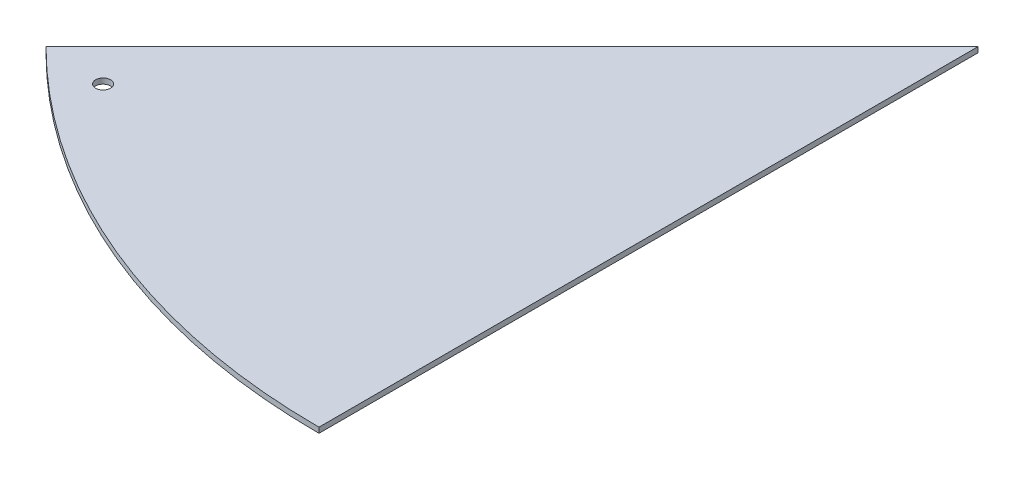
ISO-10303-21;
HEADER;
FILE_DESCRIPTION(('STEP AP214'),'2;1');
FILE_NAME('part.step','',(''),(''),'','','');
FILE_SCHEMA(('AUTOMOTIVE_DESIGN { 1 0 10303 214 1 1 1 1 }'));
ENDSEC;
DATA;
#1=APPLICATION_CONTEXT('core data for automotive mechanical design processes');
#2=APPLICATION_PROTOCOL_DEFINITION('international standard','automotive_design',2000,#1);
#3=PRODUCT_CONTEXT('',#1,'mechanical');
#4=PRODUCT('Part','Part','',(#3));
#5=PRODUCT_RELATED_PRODUCT_CATEGORY('part','',(#4));
#6=PRODUCT_DEFINITION_FORMATION('','',#4);
#7=PRODUCT_DEFINITION_CONTEXT('part definition',#1,'design');
#8=PRODUCT_DEFINITION('design','',#6,#7);
#9=PRODUCT_DEFINITION_SHAPE('','',#8);
#10=(LENGTH_UNIT() NAMED_UNIT(*) SI_UNIT(.MILLI.,.METRE.));
#11=(NAMED_UNIT(*) PLANE_ANGLE_UNIT() SI_UNIT($,.RADIAN.));
#12=(NAMED_UNIT(*) SI_UNIT($,.STERADIAN.) SOLID_ANGLE_UNIT());
#13=UNCERTAINTY_MEASURE_WITH_UNIT(LENGTH_MEASURE(1.E-05),#10,'distance_accuracy_value','');
#14=(GEOMETRIC_REPRESENTATION_CONTEXT(3) GLOBAL_UNCERTAINTY_ASSIGNED_CONTEXT((#13)) GLOBAL_UNIT_ASSIGNED_CONTEXT((#10,
#11,#12)) REPRESENTATION_CONTEXT('',''));
#15=CARTESIAN_POINT('',(0.,0.,0.));
#16=DIRECTION('',(0.,0.,1.));
#17=DIRECTION('',(1.,0.,0.));
#18=AXIS2_PLACEMENT_3D('',#15,#16,#17);
#19=CARTESIAN_POINT('',(0.,20.,0.));
#20=DIRECTION('',(0.707106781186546,0.,0.707106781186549));
#21=DIRECTION('',(0.707106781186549,0.,-0.707106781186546));
#22=AXIS2_PLACEMENT_3D('',#19,#20,#21);
#23=PLANE('',#22);
#24=DIRECTION('',(-0.707106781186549,0.,0.707106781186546));
#25=VECTOR('',#24,1.);
#26=CARTESIAN_POINT('',(0.,0.,0.));
#27=LINE('',#26,#25);
#28=CARTESIAN_POINT('',(0.,0.,0.));
#29=VERTEX_POINT('',#28);
#30=CARTESIAN_POINT('',(-1732.41161390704,0.,1732.41161390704));
#31=VERTEX_POINT('',#30);
#32=EDGE_CURVE('E79',#29,#31,#27,.T.);
#33=ORIENTED_EDGE('',*,*,#32,.T.);
#34=DIRECTION('',(0.,-1.,0.));
#35=VECTOR('',#34,1.);
#36=CARTESIAN_POINT('',(-1732.41161390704,20.,1732.41161390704));
#37=LINE('',#36,#35);
#38=CARTESIAN_POINT('',(-1732.41161390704,20.,1732.41161390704));
#39=VERTEX_POINT('',#38);
#40=EDGE_CURVE('E11',#39,#31,#37,.T.);
#41=ORIENTED_EDGE('',*,*,#40,.F.);
#42=DIRECTION('',(-0.707106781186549,0.,0.707106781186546));
#43=VECTOR('',#42,1.);
#44=CARTESIAN_POINT('',(0.,20.,0.));
#45=LINE('',#44,#43);
#46=CARTESIAN_POINT('',(0.,20.,0.));
#47=VERTEX_POINT('',#46);
#48=EDGE_CURVE('E72',#47,#39,#45,.T.);
#49=ORIENTED_EDGE('',*,*,#48,.F.);
#50=DIRECTION('',(0.,-1.,0.));
#51=VECTOR('',#50,1.);
#52=CARTESIAN_POINT('',(0.,20.,0.));
#53=LINE('',#52,#51);
#54=EDGE_CURVE('E80',#47,#29,#53,.T.);
#55=ORIENTED_EDGE('',*,*,#54,.T.);
#56=EDGE_LOOP('',(#33,#41,#49,#55));
#57=FACE_BOUND('',#56,.T.);
#58=ADVANCED_FACE('F32',(#57),#23,.F.);
#59=CARTESIAN_POINT('',(0.,20.,0.));
#60=DIRECTION('',(0.,-1.,0.));
#61=DIRECTION('',(0.,0.,-1.));
#62=AXIS2_PLACEMENT_3D('',#59,#60,#61);
#63=CYLINDRICAL_SURFACE('',#62,2450.);
#64=CARTESIAN_POINT('',(0.,0.,0.));
#65=DIRECTION('',(0.,1.,0.));
#66=DIRECTION('',(0.,0.,1.));
#67=AXIS2_PLACEMENT_3D('',#64,#65,#66);
#68=CIRCLE('',#67,2450.);
#69=CARTESIAN_POINT('',(3.00038465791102E-13,0.,2450.));
#70=VERTEX_POINT('',#69);
#71=EDGE_CURVE('E60',#31,#70,#68,.T.);
#72=ORIENTED_EDGE('',*,*,#71,.T.);
#73=DIRECTION('',(0.,-1.,0.));
#74=VECTOR('',#73,1.);
#75=CARTESIAN_POINT('',(3.00038465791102E-13,20.,2450.));
#76=LINE('',#75,#74);
#77=CARTESIAN_POINT('',(3.00038465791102E-13,20.,2450.));
#78=VERTEX_POINT('',#77);
#79=EDGE_CURVE('E40',#78,#70,#76,.T.);
#80=ORIENTED_EDGE('',*,*,#79,.F.);
#81=CARTESIAN_POINT('',(0.,20.,0.));
#82=DIRECTION('',(0.,1.,0.));
#83=DIRECTION('',(0.,0.,1.));
#84=AXIS2_PLACEMENT_3D('',#81,#82,#83);
#85=CIRCLE('',#84,2450.);
#86=EDGE_CURVE('E68',#39,#78,#85,.T.);
#87=ORIENTED_EDGE('',*,*,#86,.F.);
#88=ORIENTED_EDGE('',*,*,#40,.T.);
#89=EDGE_LOOP('',(#72,#80,#87,#88));
#90=FACE_BOUND('',#89,.T.);
#91=ADVANCED_FACE('F69',(#90),#63,.T.);
#92=CARTESIAN_POINT('',(0.,20.,0.));
#93=DIRECTION('',(-1.,0.,0.));
#94=DIRECTION('',(0.,0.,1.));
#95=AXIS2_PLACEMENT_3D('',#92,#93,#94);
#96=PLANE('',#95);
#97=DIRECTION('',(0.,0.,-1.));
#98=VECTOR('',#97,1.);
#99=CARTESIAN_POINT('',(0.,0.,0.));
#100=LINE('',#99,#98);
#101=EDGE_CURVE('E65',#70,#29,#100,.T.);
#102=ORIENTED_EDGE('',*,*,#101,.T.);
#103=ORIENTED_EDGE('',*,*,#54,.F.);
#104=DIRECTION('',(0.,0.,-1.));
#105=VECTOR('',#104,1.);
#106=CARTESIAN_POINT('',(0.,20.,0.));
#107=LINE('',#106,#105);
#108=EDGE_CURVE('E48',#78,#47,#107,.T.);
#109=ORIENTED_EDGE('',*,*,#108,.F.);
#110=ORIENTED_EDGE('',*,*,#79,.T.);
#111=EDGE_LOOP('',(#102,#103,#109,#110));
#112=FACE_BOUND('',#111,.T.);
#113=ADVANCED_FACE('F91',(#112),#96,.F.);
#114=CARTESIAN_POINT('',(0.,20.,0.));
#115=DIRECTION('',(0.,1.,0.));
#116=DIRECTION('',(0.,0.,1.));
#117=AXIS2_PLACEMENT_3D('',#114,#115,#116);
#118=PLANE('',#117);
#119=CARTESIAN_POINT('',(-1506.13744392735,20.,1746.55374953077));
#120=DIRECTION('',(0.,1.,0.));
#121=DIRECTION('',(0.,0.,1.));
#122=AXIS2_PLACEMENT_3D('',#119,#120,#121);
#123=CIRCLE('',#122,27.4999999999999);
#124=CARTESIAN_POINT('',(-1506.13744392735,20.,1774.05374953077));
#125=VERTEX_POINT('',#124);
#126=EDGE_CURVE('E86',#125,#125,#123,.T.);
#127=ORIENTED_EDGE('',*,*,#126,.F.);
#128=EDGE_LOOP('',(#127));
#129=FACE_BOUND('',#128,.T.);
#130=ORIENTED_EDGE('',*,*,#48,.T.);
#131=ORIENTED_EDGE('',*,*,#86,.T.);
#132=ORIENTED_EDGE('',*,*,#108,.T.);
#133=EDGE_LOOP('',(#130,#131,#132));
#134=FACE_BOUND('',#133,.T.);
#135=ADVANCED_FACE('F75',(#129,#134),#118,.T.);
#136=CARTESIAN_POINT('',(0.,0.,0.));
#137=DIRECTION('',(0.,1.,0.));
#138=DIRECTION('',(0.,0.,1.));
#139=AXIS2_PLACEMENT_3D('',#136,#137,#138);
#140=PLANE('',#139);
#141=CARTESIAN_POINT('',(-1506.13744392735,0.,1746.55374953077));
#142=DIRECTION('',(0.,1.,0.));
#143=DIRECTION('',(0.,0.,1.));
#144=AXIS2_PLACEMENT_3D('',#141,#142,#143);
#145=CIRCLE('',#144,27.4999999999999);
#146=CARTESIAN_POINT('',(-1506.13744392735,0.,1774.05374953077));
#147=VERTEX_POINT('',#146);
#148=EDGE_CURVE('E82',#147,#147,#145,.T.);
#149=ORIENTED_EDGE('',*,*,#148,.T.);
#150=EDGE_LOOP('',(#149));
#151=FACE_BOUND('',#150,.T.);
#152=ORIENTED_EDGE('',*,*,#32,.F.);
#153=ORIENTED_EDGE('',*,*,#101,.F.);
#154=ORIENTED_EDGE('',*,*,#71,.F.);
#155=EDGE_LOOP('',(#152,#153,#154));
#156=FACE_BOUND('',#155,.T.);
#157=ADVANCED_FACE('F92',(#151,#156),#140,.F.);
#158=CARTESIAN_POINT('',(-1506.13744392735,0.,1746.55374953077));
#159=DIRECTION('',(0.,1.,0.));
#160=DIRECTION('',(0.,0.,1.));
#161=AXIS2_PLACEMENT_3D('',#158,#159,#160);
#162=CYLINDRICAL_SURFACE('',#161,27.4999999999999);
#163=ORIENTED_EDGE('',*,*,#148,.F.);
#164=EDGE_LOOP('',(#163));
#165=FACE_BOUND('',#164,.T.);
#166=ORIENTED_EDGE('',*,*,#126,.T.);
#167=EDGE_LOOP('',(#166));
#168=FACE_BOUND('',#167,.T.);
#169=ADVANCED_FACE('F94',(#165,#168),#162,.F.);
#170=CLOSED_SHELL('',(#58,#91,#113,#135,#157,#169));
#171=MANIFOLD_SOLID_BREP('B2',#170);
#172=ADVANCED_BREP_SHAPE_REPRESENTATION('',(#18,#171),#14);
#173=SHAPE_DEFINITION_REPRESENTATION(#9,#172);
ENDSEC;
END-ISO-10303-21;
